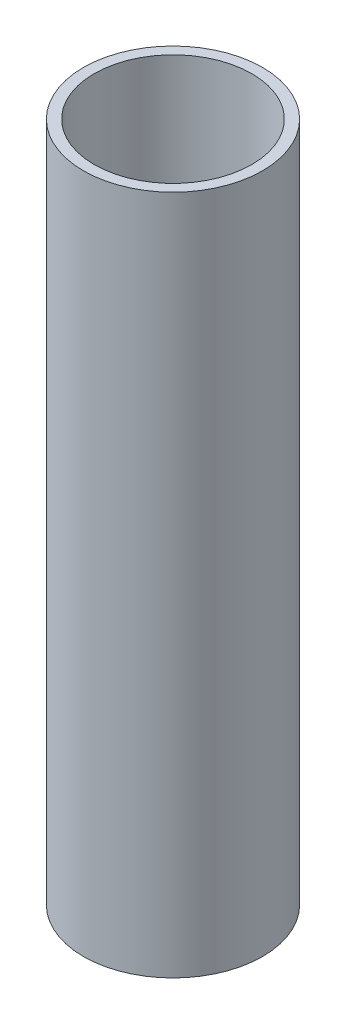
ISO-10303-21;
HEADER;
FILE_DESCRIPTION(('STEP AP214'),'2;1');
FILE_NAME('part.step','',(''),(''),'','','');
FILE_SCHEMA(('AUTOMOTIVE_DESIGN { 1 0 10303 214 1 1 1 1 }'));
ENDSEC;
DATA;
#1=APPLICATION_CONTEXT('core data for automotive mechanical design processes');
#2=APPLICATION_PROTOCOL_DEFINITION('international standard','automotive_design',2000,#1);
#3=PRODUCT_CONTEXT('',#1,'mechanical');
#4=PRODUCT('Part','Part','',(#3));
#5=PRODUCT_RELATED_PRODUCT_CATEGORY('part','',(#4));
#6=PRODUCT_DEFINITION_FORMATION('','',#4);
#7=PRODUCT_DEFINITION_CONTEXT('part definition',#1,'design');
#8=PRODUCT_DEFINITION('design','',#6,#7);
#9=PRODUCT_DEFINITION_SHAPE('','',#8);
#10=(LENGTH_UNIT() NAMED_UNIT(*) SI_UNIT(.MILLI.,.METRE.));
#11=(NAMED_UNIT(*) PLANE_ANGLE_UNIT() SI_UNIT($,.RADIAN.));
#12=(NAMED_UNIT(*) SI_UNIT($,.STERADIAN.) SOLID_ANGLE_UNIT());
#13=UNCERTAINTY_MEASURE_WITH_UNIT(LENGTH_MEASURE(1.E-05),#10,'distance_accuracy_value','');
#14=(GEOMETRIC_REPRESENTATION_CONTEXT(3) GLOBAL_UNCERTAINTY_ASSIGNED_CONTEXT((#13)) GLOBAL_UNIT_ASSIGNED_CONTEXT((#10,
#11,#12)) REPRESENTATION_CONTEXT('',''));
#15=CARTESIAN_POINT('',(0.,0.,0.));
#16=DIRECTION('',(0.,0.,1.));
#17=DIRECTION('',(1.,0.,0.));
#18=AXIS2_PLACEMENT_3D('',#15,#16,#17);
#19=CARTESIAN_POINT('',(0.,190.,0.));
#20=DIRECTION('',(0.,1.,0.));
#21=DIRECTION('',(0.,0.,1.));
#22=AXIS2_PLACEMENT_3D('',#19,#20,#21);
#23=PLANE('',#22);
#24=CARTESIAN_POINT('',(0.,190.,0.));
#25=DIRECTION('',(0.,1.,0.));
#26=DIRECTION('',(0.,0.,1.));
#27=AXIS2_PLACEMENT_3D('',#24,#25,#26);
#28=CIRCLE('',#27,25.);
#29=CARTESIAN_POINT('',(0.,190.,25.));
#30=VERTEX_POINT('',#29);
#31=EDGE_CURVE('E10',#30,#30,#28,.T.);
#32=ORIENTED_EDGE('',*,*,#31,.T.);
#33=EDGE_LOOP('',(#32));
#34=FACE_BOUND('',#33,.T.);
#35=CARTESIAN_POINT('',(0.,190.,0.));
#36=DIRECTION('',(0.,1.,0.));
#37=DIRECTION('',(0.,0.,1.));
#38=AXIS2_PLACEMENT_3D('',#35,#36,#37);
#39=CIRCLE('',#38,22.);
#40=CARTESIAN_POINT('',(0.,190.,22.));
#41=VERTEX_POINT('',#40);
#42=EDGE_CURVE('E43',#41,#41,#39,.T.);
#43=ORIENTED_EDGE('',*,*,#42,.F.);
#44=EDGE_LOOP('',(#43));
#45=FACE_BOUND('',#44,.T.);
#46=ADVANCED_FACE('F32',(#34,#45),#23,.T.);
#47=CARTESIAN_POINT('',(0.,0.,0.));
#48=DIRECTION('',(0.,1.,0.));
#49=DIRECTION('',(0.,0.,1.));
#50=AXIS2_PLACEMENT_3D('',#47,#48,#49);
#51=PLANE('',#50);
#52=CARTESIAN_POINT('',(0.,0.,0.));
#53=DIRECTION('',(0.,1.,0.));
#54=DIRECTION('',(0.,0.,1.));
#55=AXIS2_PLACEMENT_3D('',#52,#53,#54);
#56=CIRCLE('',#55,25.);
#57=CARTESIAN_POINT('',(0.,0.,25.));
#58=VERTEX_POINT('',#57);
#59=EDGE_CURVE('E36',#58,#58,#56,.T.);
#60=ORIENTED_EDGE('',*,*,#59,.F.);
#61=EDGE_LOOP('',(#60));
#62=FACE_BOUND('',#61,.T.);
#63=CARTESIAN_POINT('',(0.,0.,0.));
#64=DIRECTION('',(0.,1.,0.));
#65=DIRECTION('',(0.,0.,1.));
#66=AXIS2_PLACEMENT_3D('',#63,#64,#65);
#67=CIRCLE('',#66,22.);
#68=CARTESIAN_POINT('',(0.,0.,22.));
#69=VERTEX_POINT('',#68);
#70=EDGE_CURVE('E45',#69,#69,#67,.T.);
#71=ORIENTED_EDGE('',*,*,#70,.T.);
#72=EDGE_LOOP('',(#71));
#73=FACE_BOUND('',#72,.T.);
#74=ADVANCED_FACE('F55',(#62,#73),#51,.F.);
#75=CARTESIAN_POINT('',(0.,190.,0.));
#76=DIRECTION('',(0.,-1.,0.));
#77=DIRECTION('',(0.,0.,-1.));
#78=AXIS2_PLACEMENT_3D('',#75,#76,#77);
#79=CYLINDRICAL_SURFACE('',#78,25.);
#80=ORIENTED_EDGE('',*,*,#31,.F.);
#81=EDGE_LOOP('',(#80));
#82=FACE_BOUND('',#81,.T.);
#83=ORIENTED_EDGE('',*,*,#59,.T.);
#84=EDGE_LOOP('',(#83));
#85=FACE_BOUND('',#84,.T.);
#86=ADVANCED_FACE('F34',(#82,#85),#79,.T.);
#87=CARTESIAN_POINT('',(0.,190.,0.));
#88=DIRECTION('',(0.,-1.,0.));
#89=DIRECTION('',(0.,0.,-1.));
#90=AXIS2_PLACEMENT_3D('',#87,#88,#89);
#91=CYLINDRICAL_SURFACE('',#90,22.);
#92=ORIENTED_EDGE('',*,*,#42,.T.);
#93=EDGE_LOOP('',(#92));
#94=FACE_BOUND('',#93,.T.);
#95=ORIENTED_EDGE('',*,*,#70,.F.);
#96=EDGE_LOOP('',(#95));
#97=FACE_BOUND('',#96,.T.);
#98=ADVANCED_FACE('F51',(#94,#97),#91,.F.);
#99=CLOSED_SHELL('',(#46,#74,#86,#98));
#100=MANIFOLD_SOLID_BREP('B2',#99);
#101=ADVANCED_BREP_SHAPE_REPRESENTATION('',(#18,#100),#14);
#102=SHAPE_DEFINITION_REPRESENTATION(#9,#101);
ENDSEC;
END-ISO-10303-21;
